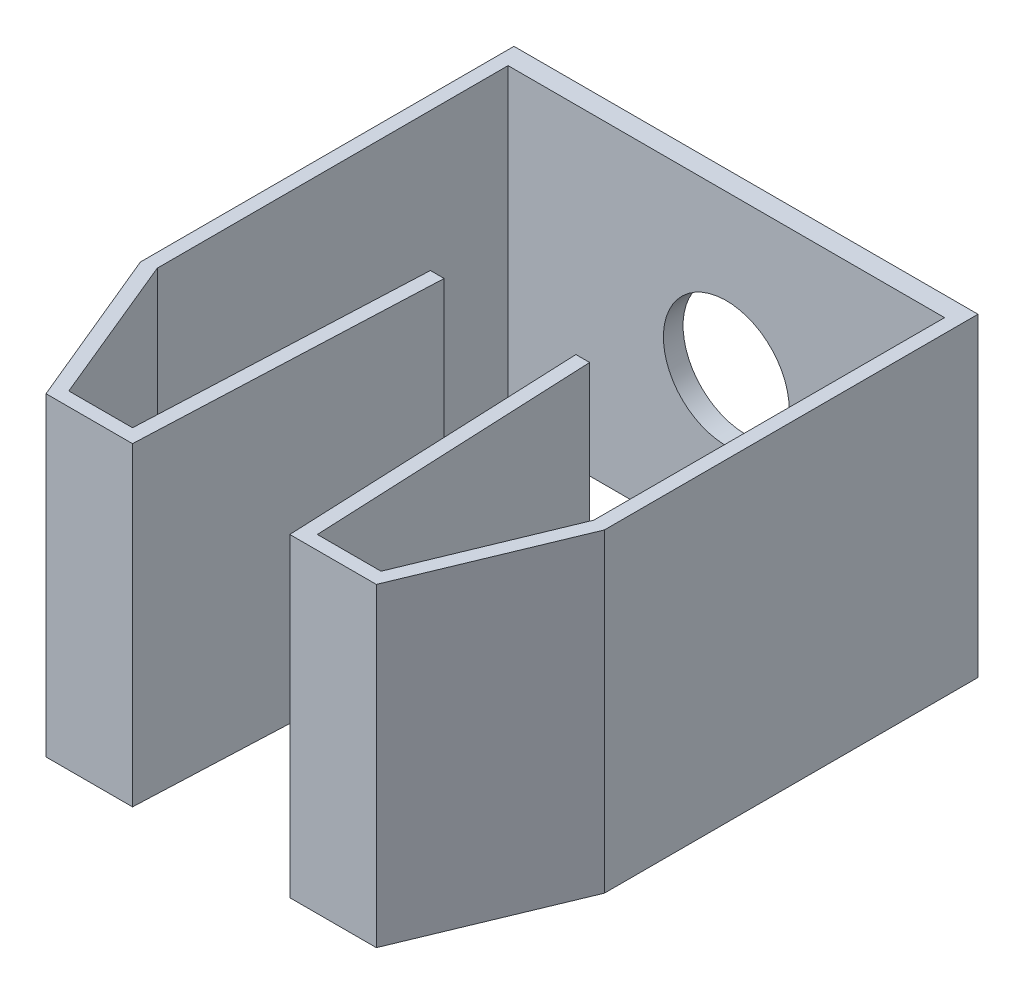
ISO-10303-21;
HEADER;
FILE_DESCRIPTION(('STEP AP214'),'2;1');
FILE_NAME('part.step','',(''),(''),'','','');
FILE_SCHEMA(('AUTOMOTIVE_DESIGN { 1 0 10303 214 1 1 1 1 }'));
ENDSEC;
DATA;
#1=APPLICATION_CONTEXT('core data for automotive mechanical design processes');
#2=APPLICATION_PROTOCOL_DEFINITION('international standard','automotive_design',2000,#1);
#3=PRODUCT_CONTEXT('',#1,'mechanical');
#4=PRODUCT('Part','Part','',(#3));
#5=PRODUCT_RELATED_PRODUCT_CATEGORY('part','',(#4));
#6=PRODUCT_DEFINITION_FORMATION('','',#4);
#7=PRODUCT_DEFINITION_CONTEXT('part definition',#1,'design');
#8=PRODUCT_DEFINITION('design','',#6,#7);
#9=PRODUCT_DEFINITION_SHAPE('','',#8);
#10=(LENGTH_UNIT() NAMED_UNIT(*) SI_UNIT(.MILLI.,.METRE.));
#11=(NAMED_UNIT(*) PLANE_ANGLE_UNIT() SI_UNIT($,.RADIAN.));
#12=(NAMED_UNIT(*) SI_UNIT($,.STERADIAN.) SOLID_ANGLE_UNIT());
#13=UNCERTAINTY_MEASURE_WITH_UNIT(LENGTH_MEASURE(1.E-05),#10,'distance_accuracy_value','');
#14=(GEOMETRIC_REPRESENTATION_CONTEXT(3) GLOBAL_UNCERTAINTY_ASSIGNED_CONTEXT((#13)) GLOBAL_UNIT_ASSIGNED_CONTEXT((#10,
#11,#12)) REPRESENTATION_CONTEXT('',''));
#15=CARTESIAN_POINT('',(0.,0.,0.));
#16=DIRECTION('',(0.,0.,1.));
#17=DIRECTION('',(1.,0.,0.));
#18=AXIS2_PLACEMENT_3D('',#15,#16,#17);
#19=CARTESIAN_POINT('',(-5.9,-52.5,-13.5));
#20=DIRECTION('',(0.,1.,0.));
#21=DIRECTION('',(0.,0.,-1.));
#22=AXIS2_PLACEMENT_3D('',#19,#20,#21);
#23=PLANE('',#22);
#24=DIRECTION('',(0.,0.,1.));
#25=VECTOR('',#24,1.);
#26=CARTESIAN_POINT('',(5.9,-52.5,-13.5));
#27=LINE('',#26,#25);
#28=CARTESIAN_POINT('',(5.9,-52.5,-13.5));
#29=VERTEX_POINT('',#28);
#30=CARTESIAN_POINT('',(5.9,-52.5,-4.));
#31=VERTEX_POINT('',#30);
#32=EDGE_CURVE('E237',#29,#31,#27,.T.);
#33=ORIENTED_EDGE('',*,*,#32,.T.);
#34=DIRECTION('',(-0.383015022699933,0.,0.92374211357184));
#35=VECTOR('',#34,1.);
#36=CARTESIAN_POINT('',(5.9,-52.5,-4.));
#37=LINE('',#36,#35);
#38=CARTESIAN_POINT('',(4.2,-52.5,0.1));
#39=VERTEX_POINT('',#38);
#40=EDGE_CURVE('E233',#31,#39,#37,.T.);
#41=ORIENTED_EDGE('',*,*,#40,.T.);
#42=DIRECTION('',(-1.,0.,0.));
#43=VECTOR('',#42,1.);
#44=CARTESIAN_POINT('',(4.2,-52.5,0.1));
#45=LINE('',#44,#43);
#46=CARTESIAN_POINT('',(2.,-52.5,0.1));
#47=VERTEX_POINT('',#46);
#48=EDGE_CURVE('E152',#39,#47,#45,.T.);
#49=ORIENTED_EDGE('',*,*,#48,.T.);
#50=DIRECTION('',(-0.0427241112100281,0.,-0.999086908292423));
#51=VECTOR('',#50,1.);
#52=CARTESIAN_POINT('',(2.,-52.5,0.1));
#53=LINE('',#52,#51);
#54=CARTESIAN_POINT('',(1.675,-52.5,-7.5));
#55=VERTEX_POINT('',#54);
#56=EDGE_CURVE('E193',#47,#55,#53,.T.);
#57=ORIENTED_EDGE('',*,*,#56,.T.);
#58=DIRECTION('',(1.,0.,0.));
#59=VECTOR('',#58,1.);
#60=CARTESIAN_POINT('',(1.675,-52.5,-7.5));
#61=LINE('',#60,#59);
#62=CARTESIAN_POINT('',(2.025,-52.5,-7.5));
#63=VERTEX_POINT('',#62);
#64=EDGE_CURVE('E153',#55,#63,#61,.T.);
#65=ORIENTED_EDGE('',*,*,#64,.T.);
#66=DIRECTION('',(0.0447826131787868,0.,0.998996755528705));
#67=VECTOR('',#66,1.);
#68=CARTESIAN_POINT('',(2.025,-52.5,-7.5));
#69=LINE('',#68,#67);
#70=CARTESIAN_POINT('',(2.35,-52.5,-0.25));
#71=VERTEX_POINT('',#70);
#72=EDGE_CURVE('E181',#63,#71,#69,.T.);
#73=ORIENTED_EDGE('',*,*,#72,.T.);
#74=DIRECTION('',(1.,0.,0.));
#75=VECTOR('',#74,1.);
#76=CARTESIAN_POINT('',(2.35,-52.5,-0.25));
#77=LINE('',#76,#75);
#78=CARTESIAN_POINT('',(3.97,-52.5,-0.25));
#79=VERTEX_POINT('',#78);
#80=EDGE_CURVE('E226',#71,#79,#77,.T.);
#81=ORIENTED_EDGE('',*,*,#80,.T.);
#82=DIRECTION('',(0.381356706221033,0.,-0.924427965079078));
#83=VECTOR('',#82,1.);
#84=CARTESIAN_POINT('',(3.97,-52.5,-0.25));
#85=LINE('',#84,#83);
#86=CARTESIAN_POINT('',(5.55,-52.5,-4.08));
#87=VERTEX_POINT('',#86);
#88=EDGE_CURVE('E238',#79,#87,#85,.T.);
#89=ORIENTED_EDGE('',*,*,#88,.T.);
#90=DIRECTION('',(0.,0.,-1.));
#91=VECTOR('',#90,1.);
#92=CARTESIAN_POINT('',(5.55,-52.5,-4.08));
#93=LINE('',#92,#91);
#94=CARTESIAN_POINT('',(5.55,-52.5,-13.));
#95=VERTEX_POINT('',#94);
#96=EDGE_CURVE('E188',#87,#95,#93,.T.);
#97=ORIENTED_EDGE('',*,*,#96,.T.);
#98=DIRECTION('',(1.,0.,0.));
#99=VECTOR('',#98,1.);
#100=CARTESIAN_POINT('',(-5.9,-52.5,-13.));
#101=LINE('',#100,#99);
#102=CARTESIAN_POINT('',(-5.55,-52.5,-13.));
#103=VERTEX_POINT('',#102);
#104=EDGE_CURVE('E175',#103,#95,#101,.T.);
#105=ORIENTED_EDGE('',*,*,#104,.F.);
#106=DIRECTION('',(0.,0.,-1.));
#107=VECTOR('',#106,1.);
#108=CARTESIAN_POINT('',(-5.55,-52.5,-4.08));
#109=LINE('',#108,#107);
#110=CARTESIAN_POINT('',(-5.55,-52.5,-4.08));
#111=VERTEX_POINT('',#110);
#112=EDGE_CURVE('E222',#111,#103,#109,.T.);
#113=ORIENTED_EDGE('',*,*,#112,.F.);
#114=DIRECTION('',(-0.381356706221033,0.,-0.924427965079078));
#115=VECTOR('',#114,1.);
#116=CARTESIAN_POINT('',(-3.97,-52.5,-0.25));
#117=LINE('',#116,#115);
#118=CARTESIAN_POINT('',(-3.97,-52.5,-0.25));
#119=VERTEX_POINT('',#118);
#120=EDGE_CURVE('E252',#119,#111,#117,.T.);
#121=ORIENTED_EDGE('',*,*,#120,.F.);
#122=DIRECTION('',(-1.,0.,0.));
#123=VECTOR('',#122,1.);
#124=CARTESIAN_POINT('',(-2.35,-52.5,-0.25));
#125=LINE('',#124,#123);
#126=CARTESIAN_POINT('',(-2.35,-52.5,-0.25));
#127=VERTEX_POINT('',#126);
#128=EDGE_CURVE('E250',#127,#119,#125,.T.);
#129=ORIENTED_EDGE('',*,*,#128,.F.);
#130=DIRECTION('',(-0.0447826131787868,0.,0.998996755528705));
#131=VECTOR('',#130,1.);
#132=CARTESIAN_POINT('',(-2.025,-52.5,-7.5));
#133=LINE('',#132,#131);
#134=CARTESIAN_POINT('',(-2.025,-52.5,-7.5));
#135=VERTEX_POINT('',#134);
#136=EDGE_CURVE('E20',#135,#127,#133,.T.);
#137=ORIENTED_EDGE('',*,*,#136,.F.);
#138=DIRECTION('',(-1.,0.,0.));
#139=VECTOR('',#138,1.);
#140=CARTESIAN_POINT('',(-1.675,-52.5,-7.5));
#141=LINE('',#140,#139);
#142=CARTESIAN_POINT('',(-1.675,-52.5,-7.5));
#143=VERTEX_POINT('',#142);
#144=EDGE_CURVE('E159',#143,#135,#141,.T.);
#145=ORIENTED_EDGE('',*,*,#144,.F.);
#146=DIRECTION('',(0.0427241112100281,0.,-0.999086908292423));
#147=VECTOR('',#146,1.);
#148=CARTESIAN_POINT('',(-2.,-52.5,0.1));
#149=LINE('',#148,#147);
#150=CARTESIAN_POINT('',(-2.,-52.5,0.1));
#151=VERTEX_POINT('',#150);
#152=EDGE_CURVE('E165',#151,#143,#149,.T.);
#153=ORIENTED_EDGE('',*,*,#152,.F.);
#154=DIRECTION('',(1.,0.,0.));
#155=VECTOR('',#154,1.);
#156=CARTESIAN_POINT('',(-4.2,-52.5,0.1));
#157=LINE('',#156,#155);
#158=CARTESIAN_POINT('',(-4.2,-52.5,0.1));
#159=VERTEX_POINT('',#158);
#160=EDGE_CURVE('E122',#159,#151,#157,.T.);
#161=ORIENTED_EDGE('',*,*,#160,.F.);
#162=DIRECTION('',(0.383015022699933,0.,0.92374211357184));
#163=VECTOR('',#162,1.);
#164=CARTESIAN_POINT('',(-5.9,-52.5,-4.));
#165=LINE('',#164,#163);
#166=CARTESIAN_POINT('',(-5.9,-52.5,-4.));
#167=VERTEX_POINT('',#166);
#168=EDGE_CURVE('E114',#167,#159,#165,.T.);
#169=ORIENTED_EDGE('',*,*,#168,.F.);
#170=DIRECTION('',(0.,0.,1.));
#171=VECTOR('',#170,1.);
#172=CARTESIAN_POINT('',(-5.9,-52.5,-13.5));
#173=LINE('',#172,#171);
#174=CARTESIAN_POINT('',(-5.9,-52.5,-13.5));
#175=VERTEX_POINT('',#174);
#176=EDGE_CURVE('E117',#175,#167,#173,.T.);
#177=ORIENTED_EDGE('',*,*,#176,.F.);
#178=DIRECTION('',(1.,0.,0.));
#179=VECTOR('',#178,1.);
#180=CARTESIAN_POINT('',(-5.9,-52.5,-13.5));
#181=LINE('',#180,#179);
#182=EDGE_CURVE('E10',#175,#29,#181,.T.);
#183=ORIENTED_EDGE('',*,*,#182,.T.);
#184=EDGE_LOOP('',(#33,#41,#49,#57,#65,#73,#81,#89,#97,#105,#113,#121,#129,#137,#145,#153,#161,
#169,#177,#183));
#185=FACE_BOUND('',#184,.T.);
#186=ADVANCED_FACE('F16',(#185),#23,.F.);
#187=CARTESIAN_POINT('',(-5.9,-52.5,-13.5));
#188=DIRECTION('',(0.,0.,1.));
#189=DIRECTION('',(0.,-1.,0.));
#190=AXIS2_PLACEMENT_3D('',#187,#188,#189);
#191=PLANE('',#190);
#192=CARTESIAN_POINT('',(0.,-48.5,-13.5));
#193=DIRECTION('',(0.,0.,1.));
#194=DIRECTION('',(1.,0.,0.));
#195=AXIS2_PLACEMENT_3D('',#192,#193,#194);
#196=CIRCLE('',#195,1.6);
#197=CARTESIAN_POINT('',(1.6,-48.5,-13.5));
#198=VERTEX_POINT('',#197);
#199=EDGE_CURVE('E198',#198,#198,#196,.T.);
#200=ORIENTED_EDGE('',*,*,#199,.T.);
#201=EDGE_LOOP('',(#200));
#202=FACE_BOUND('',#201,.T.);
#203=DIRECTION('',(1.,0.,0.));
#204=VECTOR('',#203,1.);
#205=CARTESIAN_POINT('',(-5.9,-44.5,-13.5));
#206=LINE('',#205,#204);
#207=CARTESIAN_POINT('',(-5.9,-44.5,-13.5));
#208=VERTEX_POINT('',#207);
#209=CARTESIAN_POINT('',(5.9,-44.5,-13.5));
#210=VERTEX_POINT('',#209);
#211=EDGE_CURVE('E27',#208,#210,#206,.T.);
#212=ORIENTED_EDGE('',*,*,#211,.T.);
#213=DIRECTION('',(0.,1.,0.));
#214=VECTOR('',#213,1.);
#215=CARTESIAN_POINT('',(5.9,-52.5,-13.5));
#216=LINE('',#215,#214);
#217=EDGE_CURVE('E245',#29,#210,#216,.T.);
#218=ORIENTED_EDGE('',*,*,#217,.F.);
#219=ORIENTED_EDGE('',*,*,#182,.F.);
#220=DIRECTION('',(0.,1.,0.));
#221=VECTOR('',#220,1.);
#222=CARTESIAN_POINT('',(-5.9,-52.5,-13.5));
#223=LINE('',#222,#221);
#224=EDGE_CURVE('E132',#175,#208,#223,.T.);
#225=ORIENTED_EDGE('',*,*,#224,.T.);
#226=EDGE_LOOP('',(#212,#218,#219,#225));
#227=FACE_BOUND('',#226,.T.);
#228=ADVANCED_FACE('F353',(#202,#227),#191,.F.);
#229=CARTESIAN_POINT('',(-5.9,-44.5,-13.5));
#230=DIRECTION('',(0.,1.,0.));
#231=DIRECTION('',(0.,0.,-1.));
#232=AXIS2_PLACEMENT_3D('',#229,#230,#231);
#233=PLANE('',#232);
#234=ORIENTED_EDGE('',*,*,#211,.F.);
#235=DIRECTION('',(0.,0.,-1.));
#236=VECTOR('',#235,1.);
#237=CARTESIAN_POINT('',(-5.9,-44.5,-4.));
#238=LINE('',#237,#236);
#239=CARTESIAN_POINT('',(-5.9,-44.5,-4.));
#240=VERTEX_POINT('',#239);
#241=EDGE_CURVE('E137',#240,#208,#238,.T.);
#242=ORIENTED_EDGE('',*,*,#241,.F.);
#243=DIRECTION('',(0.383015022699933,0.,0.92374211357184));
#244=VECTOR('',#243,1.);
#245=CARTESIAN_POINT('',(-5.9,-44.5,-4.));
#246=LINE('',#245,#244);
#247=CARTESIAN_POINT('',(-4.2,-44.5,0.1));
#248=VERTEX_POINT('',#247);
#249=EDGE_CURVE('E102',#240,#248,#246,.T.);
#250=ORIENTED_EDGE('',*,*,#249,.T.);
#251=DIRECTION('',(1.,0.,0.));
#252=VECTOR('',#251,1.);
#253=CARTESIAN_POINT('',(-4.2,-44.5,0.1));
#254=LINE('',#253,#252);
#255=CARTESIAN_POINT('',(-2.,-44.5,0.1));
#256=VERTEX_POINT('',#255);
#257=EDGE_CURVE('E170',#248,#256,#254,.T.);
#258=ORIENTED_EDGE('',*,*,#257,.T.);
#259=DIRECTION('',(0.0427241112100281,0.,-0.999086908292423));
#260=VECTOR('',#259,1.);
#261=CARTESIAN_POINT('',(-2.,-44.5,0.1));
#262=LINE('',#261,#260);
#263=CARTESIAN_POINT('',(-1.675,-44.5,-7.5));
#264=VERTEX_POINT('',#263);
#265=EDGE_CURVE('E164',#256,#264,#262,.T.);
#266=ORIENTED_EDGE('',*,*,#265,.T.);
#267=DIRECTION('',(-1.,0.,0.));
#268=VECTOR('',#267,1.);
#269=CARTESIAN_POINT('',(-1.675,-44.5,-7.5));
#270=LINE('',#269,#268);
#271=CARTESIAN_POINT('',(-2.025,-44.5,-7.5));
#272=VERTEX_POINT('',#271);
#273=EDGE_CURVE('E298',#264,#272,#270,.T.);
#274=ORIENTED_EDGE('',*,*,#273,.T.);
#275=DIRECTION('',(-0.0447826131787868,0.,0.998996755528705));
#276=VECTOR('',#275,1.);
#277=CARTESIAN_POINT('',(-2.025,-44.5,-7.5));
#278=LINE('',#277,#276);
#279=CARTESIAN_POINT('',(-2.35,-44.5,-0.25));
#280=VERTEX_POINT('',#279);
#281=EDGE_CURVE('E246',#272,#280,#278,.T.);
#282=ORIENTED_EDGE('',*,*,#281,.T.);
#283=DIRECTION('',(-1.,0.,0.));
#284=VECTOR('',#283,1.);
#285=CARTESIAN_POINT('',(-2.35,-44.5,-0.25));
#286=LINE('',#285,#284);
#287=CARTESIAN_POINT('',(-3.97,-44.5,-0.25));
#288=VERTEX_POINT('',#287);
#289=EDGE_CURVE('E257',#280,#288,#286,.T.);
#290=ORIENTED_EDGE('',*,*,#289,.T.);
#291=DIRECTION('',(-0.381356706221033,0.,-0.924427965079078));
#292=VECTOR('',#291,1.);
#293=CARTESIAN_POINT('',(-3.97,-44.5,-0.25));
#294=LINE('',#293,#292);
#295=CARTESIAN_POINT('',(-5.55,-44.5,-4.08));
#296=VERTEX_POINT('',#295);
#297=EDGE_CURVE('E225',#288,#296,#294,.T.);
#298=ORIENTED_EDGE('',*,*,#297,.T.);
#299=DIRECTION('',(0.,0.,-1.));
#300=VECTOR('',#299,1.);
#301=CARTESIAN_POINT('',(-5.55,-44.5,-4.08));
#302=LINE('',#301,#300);
#303=CARTESIAN_POINT('',(-5.55,-44.5,-13.));
#304=VERTEX_POINT('',#303);
#305=EDGE_CURVE('E171',#296,#304,#302,.T.);
#306=ORIENTED_EDGE('',*,*,#305,.T.);
#307=DIRECTION('',(1.,0.,0.));
#308=VECTOR('',#307,1.);
#309=CARTESIAN_POINT('',(-5.9,-44.5,-13.));
#310=LINE('',#309,#308);
#311=CARTESIAN_POINT('',(5.55,-44.5,-13.));
#312=VERTEX_POINT('',#311);
#313=EDGE_CURVE('E427',#304,#312,#310,.T.);
#314=ORIENTED_EDGE('',*,*,#313,.T.);
#315=DIRECTION('',(0.,0.,-1.));
#316=VECTOR('',#315,1.);
#317=CARTESIAN_POINT('',(5.55,-44.5,-4.08));
#318=LINE('',#317,#316);
#319=CARTESIAN_POINT('',(5.55,-44.5,-4.08));
#320=VERTEX_POINT('',#319);
#321=EDGE_CURVE('E197',#320,#312,#318,.T.);
#322=ORIENTED_EDGE('',*,*,#321,.F.);
#323=DIRECTION('',(0.381356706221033,0.,-0.924427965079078));
#324=VECTOR('',#323,1.);
#325=CARTESIAN_POINT('',(3.97,-44.5,-0.25));
#326=LINE('',#325,#324);
#327=CARTESIAN_POINT('',(3.97,-44.5,-0.25));
#328=VERTEX_POINT('',#327);
#329=EDGE_CURVE('E187',#328,#320,#326,.T.);
#330=ORIENTED_EDGE('',*,*,#329,.F.);
#331=DIRECTION('',(1.,0.,0.));
#332=VECTOR('',#331,1.);
#333=CARTESIAN_POINT('',(2.35,-44.5,-0.25));
#334=LINE('',#333,#332);
#335=CARTESIAN_POINT('',(2.35,-44.5,-0.25));
#336=VERTEX_POINT('',#335);
#337=EDGE_CURVE('E230',#336,#328,#334,.T.);
#338=ORIENTED_EDGE('',*,*,#337,.F.);
#339=DIRECTION('',(0.0447826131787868,0.,0.998996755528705));
#340=VECTOR('',#339,1.);
#341=CARTESIAN_POINT('',(2.025,-44.5,-7.5));
#342=LINE('',#341,#340);
#343=CARTESIAN_POINT('',(2.025,-44.5,-7.5));
#344=VERTEX_POINT('',#343);
#345=EDGE_CURVE('E177',#344,#336,#342,.T.);
#346=ORIENTED_EDGE('',*,*,#345,.F.);
#347=DIRECTION('',(1.,0.,0.));
#348=VECTOR('',#347,1.);
#349=CARTESIAN_POINT('',(1.675,-44.5,-7.5));
#350=LINE('',#349,#348);
#351=CARTESIAN_POINT('',(1.675,-44.5,-7.5));
#352=VERTEX_POINT('',#351);
#353=EDGE_CURVE('E158',#352,#344,#350,.T.);
#354=ORIENTED_EDGE('',*,*,#353,.F.);
#355=DIRECTION('',(-0.0427241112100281,0.,-0.999086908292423));
#356=VECTOR('',#355,1.);
#357=CARTESIAN_POINT('',(2.,-44.5,0.1));
#358=LINE('',#357,#356);
#359=CARTESIAN_POINT('',(2.,-44.5,0.1));
#360=VERTEX_POINT('',#359);
#361=EDGE_CURVE('E271',#360,#352,#358,.T.);
#362=ORIENTED_EDGE('',*,*,#361,.F.);
#363=DIRECTION('',(-1.,0.,0.));
#364=VECTOR('',#363,1.);
#365=CARTESIAN_POINT('',(4.2,-44.5,0.1));
#366=LINE('',#365,#364);
#367=CARTESIAN_POINT('',(4.2,-44.5,0.1));
#368=VERTEX_POINT('',#367);
#369=EDGE_CURVE('E192',#368,#360,#366,.T.);
#370=ORIENTED_EDGE('',*,*,#369,.F.);
#371=DIRECTION('',(-0.383015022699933,0.,0.92374211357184));
#372=VECTOR('',#371,1.);
#373=CARTESIAN_POINT('',(5.9,-44.5,-4.));
#374=LINE('',#373,#372);
#375=CARTESIAN_POINT('',(5.9,-44.5,-4.));
#376=VERTEX_POINT('',#375);
#377=EDGE_CURVE('E151',#376,#368,#374,.T.);
#378=ORIENTED_EDGE('',*,*,#377,.F.);
#379=DIRECTION('',(0.,0.,-1.));
#380=VECTOR('',#379,1.);
#381=CARTESIAN_POINT('',(5.9,-44.5,-4.));
#382=LINE('',#381,#380);
#383=EDGE_CURVE('E242',#376,#210,#382,.T.);
#384=ORIENTED_EDGE('',*,*,#383,.T.);
#385=EDGE_LOOP('',(#234,#242,#250,#258,#266,#274,#282,#290,#298,#306,#314,#322,#330,#338,#346,
#354,#362,#370,#378,#384));
#386=FACE_BOUND('',#385,.T.);
#387=ADVANCED_FACE('F350',(#386),#233,.T.);
#388=CARTESIAN_POINT('',(5.9,-52.5,-13.5));
#389=DIRECTION('',(1.,0.,0.));
#390=DIRECTION('',(0.,1.,0.));
#391=AXIS2_PLACEMENT_3D('',#388,#389,#390);
#392=PLANE('',#391);
#393=ORIENTED_EDGE('',*,*,#32,.F.);
#394=ORIENTED_EDGE('',*,*,#217,.T.);
#395=ORIENTED_EDGE('',*,*,#383,.F.);
#396=DIRECTION('',(0.,1.,0.));
#397=VECTOR('',#396,1.);
#398=CARTESIAN_POINT('',(5.9,-52.5,-4.));
#399=LINE('',#398,#397);
#400=EDGE_CURVE('E148',#31,#376,#399,.T.);
#401=ORIENTED_EDGE('',*,*,#400,.F.);
#402=EDGE_LOOP('',(#393,#394,#395,#401));
#403=FACE_BOUND('',#402,.T.);
#404=ADVANCED_FACE('F352',(#403),#392,.T.);
#405=CARTESIAN_POINT('',(5.9,-52.5,-4.));
#406=DIRECTION('',(0.92374211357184,0.,0.383015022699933));
#407=DIRECTION('',(0.,-1.,0.));
#408=AXIS2_PLACEMENT_3D('',#405,#406,#407);
#409=PLANE('',#408);
#410=ORIENTED_EDGE('',*,*,#400,.T.);
#411=ORIENTED_EDGE('',*,*,#377,.T.);
#412=DIRECTION('',(0.,1.,0.));
#413=VECTOR('',#412,1.);
#414=CARTESIAN_POINT('',(4.2,-52.5,0.1));
#415=LINE('',#414,#413);
#416=EDGE_CURVE('E189',#39,#368,#415,.T.);
#417=ORIENTED_EDGE('',*,*,#416,.F.);
#418=ORIENTED_EDGE('',*,*,#40,.F.);
#419=EDGE_LOOP('',(#410,#411,#417,#418));
#420=FACE_BOUND('',#419,.T.);
#421=ADVANCED_FACE('F360',(#420),#409,.T.);
#422=CARTESIAN_POINT('',(4.2,-52.5,0.1));
#423=DIRECTION('',(0.,0.,1.));
#424=DIRECTION('',(0.,-1.,0.));
#425=AXIS2_PLACEMENT_3D('',#422,#423,#424);
#426=PLANE('',#425);
#427=ORIENTED_EDGE('',*,*,#416,.T.);
#428=ORIENTED_EDGE('',*,*,#369,.T.);
#429=DIRECTION('',(0.,1.,0.));
#430=VECTOR('',#429,1.);
#431=CARTESIAN_POINT('',(2.,-52.5,0.1));
#432=LINE('',#431,#430);
#433=EDGE_CURVE('E157',#47,#360,#432,.T.);
#434=ORIENTED_EDGE('',*,*,#433,.F.);
#435=ORIENTED_EDGE('',*,*,#48,.F.);
#436=EDGE_LOOP('',(#427,#428,#434,#435));
#437=FACE_BOUND('',#436,.T.);
#438=ADVANCED_FACE('F369',(#437),#426,.T.);
#439=CARTESIAN_POINT('',(2.,-52.5,0.1));
#440=DIRECTION('',(-0.999086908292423,0.,0.0427241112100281));
#441=DIRECTION('',(0.,1.,0.));
#442=AXIS2_PLACEMENT_3D('',#439,#440,#441);
#443=PLANE('',#442);
#444=ORIENTED_EDGE('',*,*,#433,.T.);
#445=ORIENTED_EDGE('',*,*,#361,.T.);
#446=DIRECTION('',(0.,1.,0.));
#447=VECTOR('',#446,1.);
#448=CARTESIAN_POINT('',(1.675,-52.5,-7.5));
#449=LINE('',#448,#447);
#450=EDGE_CURVE('E258',#55,#352,#449,.T.);
#451=ORIENTED_EDGE('',*,*,#450,.F.);
#452=ORIENTED_EDGE('',*,*,#56,.F.);
#453=EDGE_LOOP('',(#444,#445,#451,#452));
#454=FACE_BOUND('',#453,.T.);
#455=ADVANCED_FACE('F372',(#454),#443,.T.);
#456=CARTESIAN_POINT('',(1.675,-52.5,-7.5));
#457=DIRECTION('',(0.,0.,-1.));
#458=DIRECTION('',(0.,-1.,0.));
#459=AXIS2_PLACEMENT_3D('',#456,#457,#458);
#460=PLANE('',#459);
#461=ORIENTED_EDGE('',*,*,#450,.T.);
#462=ORIENTED_EDGE('',*,*,#353,.T.);
#463=DIRECTION('',(0.,1.,0.));
#464=VECTOR('',#463,1.);
#465=CARTESIAN_POINT('',(2.025,-52.5,-7.5));
#466=LINE('',#465,#464);
#467=EDGE_CURVE('E182',#63,#344,#466,.T.);
#468=ORIENTED_EDGE('',*,*,#467,.F.);
#469=ORIENTED_EDGE('',*,*,#64,.F.);
#470=EDGE_LOOP('',(#461,#462,#468,#469));
#471=FACE_BOUND('',#470,.T.);
#472=ADVANCED_FACE('F382',(#471),#460,.T.);
#473=CARTESIAN_POINT('',(2.025,-52.5,-7.5));
#474=DIRECTION('',(0.998996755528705,0.,-0.0447826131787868));
#475=DIRECTION('',(0.,-1.,0.));
#476=AXIS2_PLACEMENT_3D('',#473,#474,#475);
#477=PLANE('',#476);
#478=ORIENTED_EDGE('',*,*,#467,.T.);
#479=ORIENTED_EDGE('',*,*,#345,.T.);
#480=DIRECTION('',(0.,1.,0.));
#481=VECTOR('',#480,1.);
#482=CARTESIAN_POINT('',(2.35,-52.5,-0.25));
#483=LINE('',#482,#481);
#484=EDGE_CURVE('E241',#71,#336,#483,.T.);
#485=ORIENTED_EDGE('',*,*,#484,.F.);
#486=ORIENTED_EDGE('',*,*,#72,.F.);
#487=EDGE_LOOP('',(#478,#479,#485,#486));
#488=FACE_BOUND('',#487,.T.);
#489=ADVANCED_FACE('F385',(#488),#477,.T.);
#490=CARTESIAN_POINT('',(2.35,-52.5,-0.25));
#491=DIRECTION('',(0.,0.,-1.));
#492=DIRECTION('',(0.,-1.,0.));
#493=AXIS2_PLACEMENT_3D('',#490,#491,#492);
#494=PLANE('',#493);
#495=ORIENTED_EDGE('',*,*,#484,.T.);
#496=ORIENTED_EDGE('',*,*,#337,.T.);
#497=DIRECTION('',(0.,1.,0.));
#498=VECTOR('',#497,1.);
#499=CARTESIAN_POINT('',(3.97,-52.5,-0.25));
#500=LINE('',#499,#498);
#501=EDGE_CURVE('E183',#79,#328,#500,.T.);
#502=ORIENTED_EDGE('',*,*,#501,.F.);
#503=ORIENTED_EDGE('',*,*,#80,.F.);
#504=EDGE_LOOP('',(#495,#496,#502,#503));
#505=FACE_BOUND('',#504,.T.);
#506=ADVANCED_FACE('F383',(#505),#494,.T.);
#507=CARTESIAN_POINT('',(3.97,-52.5,-0.25));
#508=DIRECTION('',(-0.924427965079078,0.,-0.381356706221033));
#509=DIRECTION('',(-0.381356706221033,0.,0.924427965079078));
#510=AXIS2_PLACEMENT_3D('',#507,#508,#509);
#511=PLANE('',#510);
#512=ORIENTED_EDGE('',*,*,#501,.T.);
#513=ORIENTED_EDGE('',*,*,#329,.T.);
#514=DIRECTION('',(0.,1.,0.));
#515=VECTOR('',#514,1.);
#516=CARTESIAN_POINT('',(5.55,-52.5,-4.08));
#517=LINE('',#516,#515);
#518=EDGE_CURVE('E194',#87,#320,#517,.T.);
#519=ORIENTED_EDGE('',*,*,#518,.F.);
#520=ORIENTED_EDGE('',*,*,#88,.F.);
#521=EDGE_LOOP('',(#512,#513,#519,#520));
#522=FACE_BOUND('',#521,.T.);
#523=ADVANCED_FACE('F18',(#522),#511,.T.);
#524=CARTESIAN_POINT('',(5.55,-52.5,-4.08));
#525=DIRECTION('',(-1.,0.,0.));
#526=DIRECTION('',(0.,0.,1.));
#527=AXIS2_PLACEMENT_3D('',#524,#525,#526);
#528=PLANE('',#527);
#529=ORIENTED_EDGE('',*,*,#518,.T.);
#530=ORIENTED_EDGE('',*,*,#321,.T.);
#531=DIRECTION('',(0.,1.,0.));
#532=VECTOR('',#531,1.);
#533=CARTESIAN_POINT('',(5.55,-52.5,-13.));
#534=LINE('',#533,#532);
#535=EDGE_CURVE('E275',#95,#312,#534,.T.);
#536=ORIENTED_EDGE('',*,*,#535,.F.);
#537=ORIENTED_EDGE('',*,*,#96,.F.);
#538=EDGE_LOOP('',(#529,#530,#536,#537));
#539=FACE_BOUND('',#538,.T.);
#540=ADVANCED_FACE('F391',(#539),#528,.T.);
#541=CARTESIAN_POINT('',(0.,-48.5,-14.));
#542=DIRECTION('',(0.,0.,1.));
#543=DIRECTION('',(1.,0.,0.));
#544=AXIS2_PLACEMENT_3D('',#541,#542,#543);
#545=CYLINDRICAL_SURFACE('',#544,1.6);
#546=DIRECTION('',(0.,0.,1.));
#547=VECTOR('',#546,1.);
#548=CARTESIAN_POINT('',(1.6,-48.5,-14.));
#549=LINE('',#548,#547);
#550=CARTESIAN_POINT('',(1.6,-48.5,-13.));
#551=VERTEX_POINT('',#550);
#552=EDGE_CURVE('E209',#198,#551,#549,.T.);
#553=ORIENTED_EDGE('',*,*,#552,.F.);
#554=ORIENTED_EDGE('',*,*,#199,.F.);
#555=ORIENTED_EDGE('',*,*,#552,.T.);
#556=CARTESIAN_POINT('',(0.,-48.5,-13.));
#557=DIRECTION('',(0.,0.,1.));
#558=DIRECTION('',(1.,0.,0.));
#559=AXIS2_PLACEMENT_3D('',#556,#557,#558);
#560=CIRCLE('',#559,1.6);
#561=EDGE_CURVE('E146',#551,#551,#560,.T.);
#562=ORIENTED_EDGE('',*,*,#561,.T.);
#563=EDGE_LOOP('',(#553,#554,#555,#562));
#564=FACE_BOUND('',#563,.T.);
#565=ADVANCED_FACE('F561',(#564),#545,.F.);
#566=CARTESIAN_POINT('',(-5.9,-52.5,-13.));
#567=DIRECTION('',(0.,0.,1.));
#568=DIRECTION('',(0.,-1.,0.));
#569=AXIS2_PLACEMENT_3D('',#566,#567,#568);
#570=PLANE('',#569);
#571=ORIENTED_EDGE('',*,*,#561,.F.);
#572=EDGE_LOOP('',(#571));
#573=FACE_BOUND('',#572,.T.);
#574=DIRECTION('',(0.,1.,0.));
#575=VECTOR('',#574,1.);
#576=CARTESIAN_POINT('',(-5.55,-52.5,-13.));
#577=LINE('',#576,#575);
#578=EDGE_CURVE('E176',#103,#304,#577,.T.);
#579=ORIENTED_EDGE('',*,*,#578,.F.);
#580=ORIENTED_EDGE('',*,*,#104,.T.);
#581=ORIENTED_EDGE('',*,*,#535,.T.);
#582=ORIENTED_EDGE('',*,*,#313,.F.);
#583=EDGE_LOOP('',(#579,#580,#581,#582));
#584=FACE_BOUND('',#583,.T.);
#585=ADVANCED_FACE('F534',(#573,#584),#570,.T.);
#586=CARTESIAN_POINT('',(-5.55,-52.5,-4.08));
#587=DIRECTION('',(-1.,0.,0.));
#588=DIRECTION('',(0.,0.,1.));
#589=AXIS2_PLACEMENT_3D('',#586,#587,#588);
#590=PLANE('',#589);
#591=ORIENTED_EDGE('',*,*,#112,.T.);
#592=ORIENTED_EDGE('',*,*,#578,.T.);
#593=ORIENTED_EDGE('',*,*,#305,.F.);
#594=DIRECTION('',(0.,1.,0.));
#595=VECTOR('',#594,1.);
#596=CARTESIAN_POINT('',(-5.55,-52.5,-4.08));
#597=LINE('',#596,#595);
#598=EDGE_CURVE('E256',#111,#296,#597,.T.);
#599=ORIENTED_EDGE('',*,*,#598,.F.);
#600=EDGE_LOOP('',(#591,#592,#593,#599));
#601=FACE_BOUND('',#600,.T.);
#602=ADVANCED_FACE('F531',(#601),#590,.F.);
#603=CARTESIAN_POINT('',(-3.97,-52.5,-0.25));
#604=DIRECTION('',(-0.924427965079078,0.,0.381356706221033));
#605=DIRECTION('',(0.,1.,0.));
#606=AXIS2_PLACEMENT_3D('',#603,#604,#605);
#607=PLANE('',#606);
#608=ORIENTED_EDGE('',*,*,#120,.T.);
#609=ORIENTED_EDGE('',*,*,#598,.T.);
#610=ORIENTED_EDGE('',*,*,#297,.F.);
#611=DIRECTION('',(0.,1.,0.));
#612=VECTOR('',#611,1.);
#613=CARTESIAN_POINT('',(-3.97,-52.5,-0.25));
#614=LINE('',#613,#612);
#615=EDGE_CURVE('E292',#119,#288,#614,.T.);
#616=ORIENTED_EDGE('',*,*,#615,.F.);
#617=EDGE_LOOP('',(#608,#609,#610,#616));
#618=FACE_BOUND('',#617,.T.);
#619=ADVANCED_FACE('F527',(#618),#607,.F.);
#620=CARTESIAN_POINT('',(-2.35,-52.5,-0.25));
#621=DIRECTION('',(0.,0.,1.));
#622=DIRECTION('',(0.,-1.,0.));
#623=AXIS2_PLACEMENT_3D('',#620,#621,#622);
#624=PLANE('',#623);
#625=ORIENTED_EDGE('',*,*,#128,.T.);
#626=ORIENTED_EDGE('',*,*,#615,.T.);
#627=ORIENTED_EDGE('',*,*,#289,.F.);
#628=DIRECTION('',(0.,1.,0.));
#629=VECTOR('',#628,1.);
#630=CARTESIAN_POINT('',(-2.35,-52.5,-0.25));
#631=LINE('',#630,#629);
#632=EDGE_CURVE('E251',#127,#280,#631,.T.);
#633=ORIENTED_EDGE('',*,*,#632,.F.);
#634=EDGE_LOOP('',(#625,#626,#627,#633));
#635=FACE_BOUND('',#634,.T.);
#636=ADVANCED_FACE('F344',(#635),#624,.F.);
#637=CARTESIAN_POINT('',(-2.025,-52.5,-7.5));
#638=DIRECTION('',(0.998996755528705,0.,0.0447826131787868));
#639=DIRECTION('',(0.,-1.,0.));
#640=AXIS2_PLACEMENT_3D('',#637,#638,#639);
#641=PLANE('',#640);
#642=ORIENTED_EDGE('',*,*,#136,.T.);
#643=ORIENTED_EDGE('',*,*,#632,.T.);
#644=ORIENTED_EDGE('',*,*,#281,.F.);
#645=DIRECTION('',(0.,1.,0.));
#646=VECTOR('',#645,1.);
#647=CARTESIAN_POINT('',(-2.025,-52.5,-7.5));
#648=LINE('',#647,#646);
#649=EDGE_CURVE('E163',#135,#272,#648,.T.);
#650=ORIENTED_EDGE('',*,*,#649,.F.);
#651=EDGE_LOOP('',(#642,#643,#644,#650));
#652=FACE_BOUND('',#651,.T.);
#653=ADVANCED_FACE('F338',(#652),#641,.F.);
#654=CARTESIAN_POINT('',(-1.675,-52.5,-7.5));
#655=DIRECTION('',(0.,0.,1.));
#656=DIRECTION('',(0.,-1.,0.));
#657=AXIS2_PLACEMENT_3D('',#654,#655,#656);
#658=PLANE('',#657);
#659=ORIENTED_EDGE('',*,*,#144,.T.);
#660=ORIENTED_EDGE('',*,*,#649,.T.);
#661=ORIENTED_EDGE('',*,*,#273,.F.);
#662=DIRECTION('',(0.,1.,0.));
#663=VECTOR('',#662,1.);
#664=CARTESIAN_POINT('',(-1.675,-52.5,-7.5));
#665=LINE('',#664,#663);
#666=EDGE_CURVE('E169',#143,#264,#665,.T.);
#667=ORIENTED_EDGE('',*,*,#666,.F.);
#668=EDGE_LOOP('',(#659,#660,#661,#667));
#669=FACE_BOUND('',#668,.T.);
#670=ADVANCED_FACE('F378',(#669),#658,.F.);
#671=CARTESIAN_POINT('',(-2.,-52.5,0.1));
#672=DIRECTION('',(-0.999086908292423,0.,-0.0427241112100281));
#673=DIRECTION('',(-0.0427241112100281,0.,0.999086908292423));
#674=AXIS2_PLACEMENT_3D('',#671,#672,#673);
#675=PLANE('',#674);
#676=ORIENTED_EDGE('',*,*,#152,.T.);
#677=ORIENTED_EDGE('',*,*,#666,.T.);
#678=ORIENTED_EDGE('',*,*,#265,.F.);
#679=DIRECTION('',(0.,1.,0.));
#680=VECTOR('',#679,1.);
#681=CARTESIAN_POINT('',(-2.,-52.5,0.1));
#682=LINE('',#681,#680);
#683=EDGE_CURVE('E262',#151,#256,#682,.T.);
#684=ORIENTED_EDGE('',*,*,#683,.F.);
#685=EDGE_LOOP('',(#676,#677,#678,#684));
#686=FACE_BOUND('',#685,.T.);
#687=ADVANCED_FACE('F374',(#686),#675,.F.);
#688=CARTESIAN_POINT('',(-4.2,-52.5,0.1));
#689=DIRECTION('',(0.,0.,-1.));
#690=DIRECTION('',(0.,-1.,0.));
#691=AXIS2_PLACEMENT_3D('',#688,#689,#690);
#692=PLANE('',#691);
#693=ORIENTED_EDGE('',*,*,#160,.T.);
#694=ORIENTED_EDGE('',*,*,#683,.T.);
#695=ORIENTED_EDGE('',*,*,#257,.F.);
#696=DIRECTION('',(0.,1.,0.));
#697=VECTOR('',#696,1.);
#698=CARTESIAN_POINT('',(-4.2,-52.5,0.1));
#699=LINE('',#698,#697);
#700=EDGE_CURVE('E125',#159,#248,#699,.T.);
#701=ORIENTED_EDGE('',*,*,#700,.F.);
#702=EDGE_LOOP('',(#693,#694,#695,#701));
#703=FACE_BOUND('',#702,.T.);
#704=ADVANCED_FACE('F377',(#703),#692,.F.);
#705=CARTESIAN_POINT('',(-5.9,-52.5,-4.));
#706=DIRECTION('',(0.92374211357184,0.,-0.383015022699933));
#707=DIRECTION('',(0.,-1.,0.));
#708=AXIS2_PLACEMENT_3D('',#705,#706,#707);
#709=PLANE('',#708);
#710=ORIENTED_EDGE('',*,*,#168,.T.);
#711=ORIENTED_EDGE('',*,*,#700,.T.);
#712=ORIENTED_EDGE('',*,*,#249,.F.);
#713=DIRECTION('',(0.,1.,0.));
#714=VECTOR('',#713,1.);
#715=CARTESIAN_POINT('',(-5.9,-52.5,-4.));
#716=LINE('',#715,#714);
#717=EDGE_CURVE('E131',#167,#240,#716,.T.);
#718=ORIENTED_EDGE('',*,*,#717,.F.);
#719=EDGE_LOOP('',(#710,#711,#712,#718));
#720=FACE_BOUND('',#719,.T.);
#721=ADVANCED_FACE('F135',(#720),#709,.F.);
#722=CARTESIAN_POINT('',(-5.9,-52.5,-13.5));
#723=DIRECTION('',(1.,0.,0.));
#724=DIRECTION('',(0.,1.,0.));
#725=AXIS2_PLACEMENT_3D('',#722,#723,#724);
#726=PLANE('',#725);
#727=ORIENTED_EDGE('',*,*,#717,.T.);
#728=ORIENTED_EDGE('',*,*,#241,.T.);
#729=ORIENTED_EDGE('',*,*,#224,.F.);
#730=ORIENTED_EDGE('',*,*,#176,.T.);
#731=EDGE_LOOP('',(#727,#728,#729,#730));
#732=FACE_BOUND('',#731,.T.);
#733=ADVANCED_FACE('F129',(#732),#726,.F.);
#734=CLOSED_SHELL('',(#186,#228,#387,#404,#421,#438,#455,#472,#489,#506,#523,#540,#565,#585,
#602,#619,#636,#653,#670,#687,#704,#721,#733));
#735=MANIFOLD_SOLID_BREP('B1',#734);
#736=ADVANCED_BREP_SHAPE_REPRESENTATION('',(#18,#735),#14);
#737=SHAPE_DEFINITION_REPRESENTATION(#9,#736);
ENDSEC;
END-ISO-10303-21;
